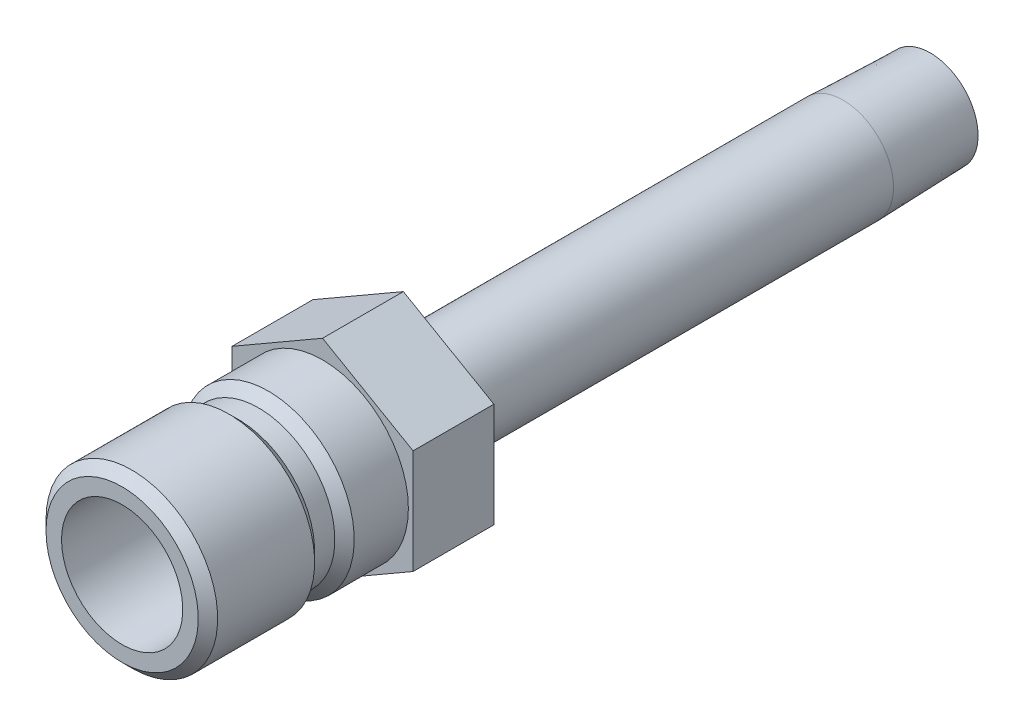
from build123d import *

# Parameters (mm, degrees)
SKETCH2_R           = 2.6543
BOSS_EXTRUDE1_DEPTH = 6.35


with BuildPart() as part:
    # Sketch1 → Revolve1 (revolve)
    with BuildSketch(Plane(origin=(0, 0, 0), x_dir=(0, 0, -1), z_dir=(1, 0, 0)), mode=Mode.PRIVATE) as revolve1_sk:
        Polygon((-15.748, 4.7625), (-15.748, 5.9817), (-14.986, 6.7437), (-7.366, 6.7437), (-6.604, 5.9817), (-5.0165, 5.9817), (-4.2545, 6.7437), (6.35, 6.7437), (6.35, 3.96875), (40.894, 3.96875), (47.752, 3.754438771), (47.752, 2.6543), (-2.435050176, 2.6543), (-3.556, 4.7625), align=None)
    revolve(revolve1_sk.sketch.rotate(Axis((0, 0, -6.35), (0, 0, 1)), 90), axis=Axis((0, 0, -6.35), (0, 0, 1)))

    # Sketch2 → Boss-Extrude1 (add)
    with BuildSketch(Plane.XY):
        Polygon((-7.112, 4.106115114), (-7.112, -4.106115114), (0, -8.212230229), (7.112, -4.106115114), (7.112, 4.106115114), (0, 8.212230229), align=None)
        with Locations(Location((0, 0, 0), (0, 0, 180))):
            Circle(SKETCH2_R, mode=Mode.SUBTRACT)
    extrude(amount=-BOSS_EXTRUDE1_DEPTH)


solid = part.part
